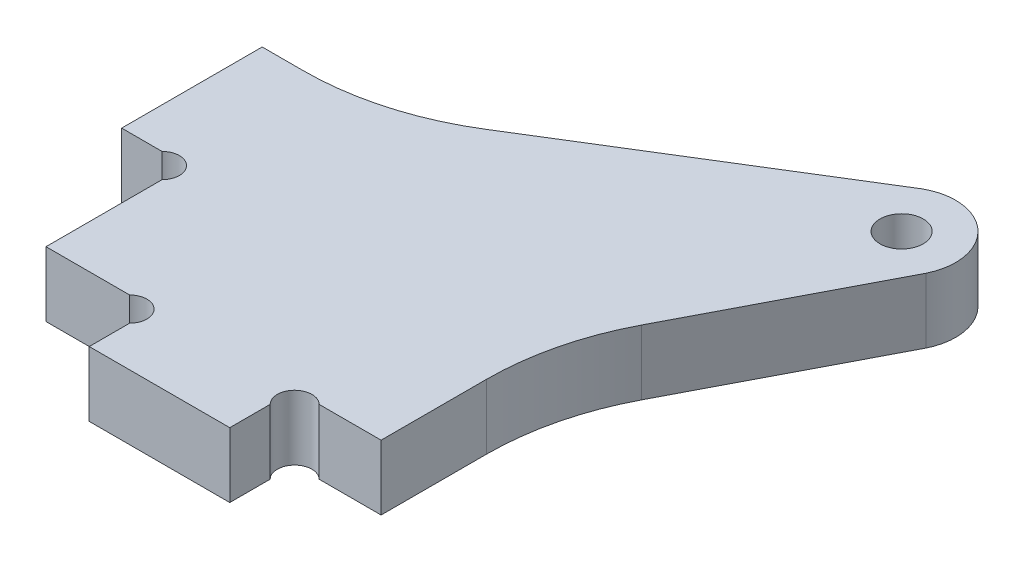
ISO-10303-21;
HEADER;
FILE_DESCRIPTION(('STEP AP214'),'2;1');
FILE_NAME('part.step','',(''),(''),'','','');
FILE_SCHEMA(('AUTOMOTIVE_DESIGN { 1 0 10303 214 1 1 1 1 }'));
ENDSEC;
DATA;
#1=APPLICATION_CONTEXT('core data for automotive mechanical design processes');
#2=APPLICATION_PROTOCOL_DEFINITION('international standard','automotive_design',2000,#1);
#3=PRODUCT_CONTEXT('',#1,'mechanical');
#4=PRODUCT('Part','Part','',(#3));
#5=PRODUCT_RELATED_PRODUCT_CATEGORY('part','',(#4));
#6=PRODUCT_DEFINITION_FORMATION('','',#4);
#7=PRODUCT_DEFINITION_CONTEXT('part definition',#1,'design');
#8=PRODUCT_DEFINITION('design','',#6,#7);
#9=PRODUCT_DEFINITION_SHAPE('','',#8);
#10=(LENGTH_UNIT() NAMED_UNIT(*) SI_UNIT(.MILLI.,.METRE.));
#11=(NAMED_UNIT(*) PLANE_ANGLE_UNIT() SI_UNIT($,.RADIAN.));
#12=(NAMED_UNIT(*) SI_UNIT($,.STERADIAN.) SOLID_ANGLE_UNIT());
#13=UNCERTAINTY_MEASURE_WITH_UNIT(LENGTH_MEASURE(1.E-05),#10,'distance_accuracy_value','');
#14=(GEOMETRIC_REPRESENTATION_CONTEXT(3) GLOBAL_UNCERTAINTY_ASSIGNED_CONTEXT((#13)) GLOBAL_UNIT_ASSIGNED_CONTEXT((#10,
#11,#12)) REPRESENTATION_CONTEXT('',''));
#15=CARTESIAN_POINT('',(0.,0.,0.));
#16=DIRECTION('',(0.,0.,1.));
#17=DIRECTION('',(1.,0.,0.));
#18=AXIS2_PLACEMENT_3D('',#15,#16,#17);
#19=CARTESIAN_POINT('',(8.86862915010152,6.,1.13137084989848));
#20=DIRECTION('',(0.,-1.,0.));
#21=DIRECTION('',(0.,0.,-1.));
#22=AXIS2_PLACEMENT_3D('',#19,#20,#21);
#23=PLANE('',#22);
#24=DIRECTION('',(1.,0.,0.));
#25=VECTOR('',#24,1.);
#26=CARTESIAN_POINT('',(0.,6.,0.));
#27=LINE('',#26,#25);
#28=CARTESIAN_POINT('',(0.,6.,0.));
#29=VERTEX_POINT('',#28);
#30=CARTESIAN_POINT('',(7.73725830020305,6.,0.));
#31=VERTEX_POINT('',#30);
#32=EDGE_CURVE('E199',#29,#31,#27,.T.);
#33=ORIENTED_EDGE('',*,*,#32,.T.);
#34=CARTESIAN_POINT('',(8.86862915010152,6.,1.13137084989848));
#35=DIRECTION('',(0.,-1.,0.));
#36=DIRECTION('',(0.,0.,-1.));
#37=AXIS2_PLACEMENT_3D('',#34,#35,#36);
#38=CIRCLE('',#37,1.6);
#39=CARTESIAN_POINT('',(10.,6.,2.26274169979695));
#40=VERTEX_POINT('',#39);
#41=EDGE_CURVE('E156',#31,#40,#38,.T.);
#42=ORIENTED_EDGE('',*,*,#41,.T.);
#43=DIRECTION('',(0.,0.,1.));
#44=VECTOR('',#43,1.);
#45=CARTESIAN_POINT('',(10.,6.,2.26274169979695));
#46=LINE('',#45,#44);
#47=CARTESIAN_POINT('',(10.,6.,6.00000000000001));
#48=VERTEX_POINT('',#47);
#49=EDGE_CURVE('E202',#40,#48,#46,.T.);
#50=ORIENTED_EDGE('',*,*,#49,.T.);
#51=DIRECTION('',(1.,0.,0.));
#52=VECTOR('',#51,1.);
#53=CARTESIAN_POINT('',(10.,6.,6.00000000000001));
#54=LINE('',#53,#52);
#55=CARTESIAN_POINT('',(23.,6.,6.00000000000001));
#56=VERTEX_POINT('',#55);
#57=EDGE_CURVE('E204',#48,#56,#54,.T.);
#58=ORIENTED_EDGE('',*,*,#57,.T.);
#59=DIRECTION('',(0.,0.,-1.));
#60=VECTOR('',#59,1.);
#61=CARTESIAN_POINT('',(23.,6.,6.00000000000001));
#62=LINE('',#61,#60);
#63=CARTESIAN_POINT('',(23.,6.,2.26274169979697));
#64=VERTEX_POINT('',#63);
#65=EDGE_CURVE('E206',#56,#64,#62,.T.);
#66=ORIENTED_EDGE('',*,*,#65,.T.);
#67=CARTESIAN_POINT('',(24.1313708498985,6.,1.13137084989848));
#68=DIRECTION('',(0.,-1.,0.));
#69=DIRECTION('',(0.,0.,1.));
#70=AXIS2_PLACEMENT_3D('',#67,#68,#69);
#71=CIRCLE('',#70,1.60000000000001);
#72=CARTESIAN_POINT('',(25.262741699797,6.,0.));
#73=VERTEX_POINT('',#72);
#74=EDGE_CURVE('E208',#64,#73,#71,.T.);
#75=ORIENTED_EDGE('',*,*,#74,.T.);
#76=DIRECTION('',(1.,0.,0.));
#77=VECTOR('',#76,1.);
#78=CARTESIAN_POINT('',(25.262741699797,6.,0.));
#79=LINE('',#78,#77);
#80=CARTESIAN_POINT('',(31.,6.,0.));
#81=VERTEX_POINT('',#80);
#82=EDGE_CURVE('E210',#73,#81,#79,.T.);
#83=ORIENTED_EDGE('',*,*,#82,.T.);
#84=DIRECTION('',(0.,0.,-1.));
#85=VECTOR('',#84,1.);
#86=CARTESIAN_POINT('',(31.,6.,-9.73463526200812));
#87=LINE('',#86,#85);
#88=CARTESIAN_POINT('',(31.,6.,-9.73463526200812));
#89=VERTEX_POINT('',#88);
#90=EDGE_CURVE('E212',#81,#89,#87,.T.);
#91=ORIENTED_EDGE('',*,*,#90,.T.);
#92=CARTESIAN_POINT('',(56.,6.,-9.73463526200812));
#93=DIRECTION('',(0.,-1.,0.));
#94=DIRECTION('',(0.,0.,1.));
#95=AXIS2_PLACEMENT_3D('',#92,#93,#94);
#96=CIRCLE('',#95,25.);
#97=CARTESIAN_POINT('',(33.8242159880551,6.,-21.277364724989));
#98=VERTEX_POINT('',#97);
#99=EDGE_CURVE('E214',#89,#98,#96,.T.);
#100=ORIENTED_EDGE('',*,*,#99,.T.);
#101=DIRECTION('',(0.461709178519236,0.,-0.887031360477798));
#102=VECTOR('',#101,1.);
#103=CARTESIAN_POINT('',(42.8240203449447,6.,-38.5677047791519));
#104=LINE('',#103,#102);
#105=CARTESIAN_POINT('',(42.8240203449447,6.,-38.5677047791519));
#106=VERTEX_POINT('',#105);
#107=EDGE_CURVE('E216',#98,#106,#104,.T.);
#108=ORIENTED_EDGE('',*,*,#107,.T.);
#109=CARTESIAN_POINT('',(38.35,6.,-40.8));
#110=DIRECTION('',(0.,1.,0.));
#111=DIRECTION('',(0.,0.,1.));
#112=AXIS2_PLACEMENT_3D('',#109,#110,#111);
#113=CIRCLE('',#112,5.);
#114=CARTESIAN_POINT('',(35.8291299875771,6.,-45.1180104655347));
#115=VERTEX_POINT('',#114);
#116=EDGE_CURVE('E218',#106,#115,#113,.T.);
#117=ORIENTED_EDGE('',*,*,#116,.T.);
#118=DIRECTION('',(-0.850852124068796,0.,0.525405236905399));
#119=VECTOR('',#118,1.);
#120=CARTESIAN_POINT('',(35.8291299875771,6.,-45.1180104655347));
#121=LINE('',#120,#119);
#122=CARTESIAN_POINT('',(10.9073568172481,6.,-29.7286968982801));
#123=VERTEX_POINT('',#122);
#124=EDGE_CURVE('E220',#115,#123,#121,.T.);
#125=ORIENTED_EDGE('',*,*,#124,.T.);
#126=CARTESIAN_POINT('',(-2.22777410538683,6.,-51.));
#127=DIRECTION('',(0.,-1.,0.));
#128=DIRECTION('',(0.,0.,-1.));
#129=AXIS2_PLACEMENT_3D('',#126,#127,#128);
#130=CIRCLE('',#129,25.);
#131=CARTESIAN_POINT('',(-2.22777410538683,6.,-26.));
#132=VERTEX_POINT('',#131);
#133=EDGE_CURVE('E222',#123,#132,#130,.T.);
#134=ORIENTED_EDGE('',*,*,#133,.T.);
#135=DIRECTION('',(-1.,0.,0.));
#136=VECTOR('',#135,1.);
#137=CARTESIAN_POINT('',(-6.,6.,-26.));
#138=LINE('',#137,#136);
#139=CARTESIAN_POINT('',(-6.,6.,-26.));
#140=VERTEX_POINT('',#139);
#141=EDGE_CURVE('E224',#132,#140,#138,.T.);
#142=ORIENTED_EDGE('',*,*,#141,.T.);
#143=DIRECTION('',(0.,0.,1.));
#144=VECTOR('',#143,1.);
#145=CARTESIAN_POINT('',(-6.,6.,-26.));
#146=LINE('',#145,#144);
#147=CARTESIAN_POINT('',(-5.99999999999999,6.,-13.));
#148=VERTEX_POINT('',#147);
#149=EDGE_CURVE('E226',#140,#148,#146,.T.);
#150=ORIENTED_EDGE('',*,*,#149,.T.);
#151=DIRECTION('',(1.,0.,0.));
#152=VECTOR('',#151,1.);
#153=CARTESIAN_POINT('',(-5.99999999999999,6.,-13.));
#154=LINE('',#153,#152);
#155=CARTESIAN_POINT('',(-2.26274169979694,6.,-13.));
#156=VERTEX_POINT('',#155);
#157=EDGE_CURVE('E228',#148,#156,#154,.T.);
#158=ORIENTED_EDGE('',*,*,#157,.T.);
#159=CARTESIAN_POINT('',(-1.13137084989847,6.,-11.8686291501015));
#160=DIRECTION('',(0.,-1.,0.));
#161=DIRECTION('',(0.,0.,1.));
#162=AXIS2_PLACEMENT_3D('',#159,#160,#161);
#163=CIRCLE('',#162,1.6);
#164=CARTESIAN_POINT('',(0.,6.,-10.737258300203));
#165=VERTEX_POINT('',#164);
#166=EDGE_CURVE('E37',#156,#165,#163,.T.);
#167=ORIENTED_EDGE('',*,*,#166,.T.);
#168=DIRECTION('',(0.,0.,1.));
#169=VECTOR('',#168,1.);
#170=CARTESIAN_POINT('',(0.,6.,-10.737258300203));
#171=LINE('',#170,#169);
#172=EDGE_CURVE('E32',#165,#29,#171,.T.);
#173=ORIENTED_EDGE('',*,*,#172,.T.);
#174=EDGE_LOOP('',(#33,#42,#50,#58,#66,#75,#83,#91,#100,#108,#117,#125,#134,#142,#150,#158,#167,#173));
#175=FACE_BOUND('',#174,.T.);
#176=CARTESIAN_POINT('',(38.35,6.,-40.8));
#177=DIRECTION('',(0.,1.,0.));
#178=DIRECTION('',(0.,0.,1.));
#179=AXIS2_PLACEMENT_3D('',#176,#177,#178);
#180=CIRCLE('',#179,2.);
#181=CARTESIAN_POINT('',(38.35,6.,-38.8));
#182=VERTEX_POINT('',#181);
#183=EDGE_CURVE('E161',#182,#182,#180,.T.);
#184=ORIENTED_EDGE('',*,*,#183,.F.);
#185=EDGE_LOOP('',(#184));
#186=FACE_BOUND('',#185,.T.);
#187=ADVANCED_FACE('F17',(#175,#186),#23,.F.);
#188=CARTESIAN_POINT('',(8.86862915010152,0.,1.13137084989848));
#189=DIRECTION('',(0.,-1.,0.));
#190=DIRECTION('',(0.,0.,-1.));
#191=AXIS2_PLACEMENT_3D('',#188,#189,#190);
#192=PLANE('',#191);
#193=DIRECTION('',(1.,0.,0.));
#194=VECTOR('',#193,1.);
#195=CARTESIAN_POINT('',(0.,0.,0.));
#196=LINE('',#195,#194);
#197=CARTESIAN_POINT('',(0.,0.,0.));
#198=VERTEX_POINT('',#197);
#199=CARTESIAN_POINT('',(7.73725830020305,0.,0.));
#200=VERTEX_POINT('',#199);
#201=EDGE_CURVE('E147',#198,#200,#196,.T.);
#202=ORIENTED_EDGE('',*,*,#201,.F.);
#203=DIRECTION('',(0.,0.,1.));
#204=VECTOR('',#203,1.);
#205=CARTESIAN_POINT('',(0.,0.,-10.737258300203));
#206=LINE('',#205,#204);
#207=CARTESIAN_POINT('',(0.,0.,-10.737258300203));
#208=VERTEX_POINT('',#207);
#209=EDGE_CURVE('E197',#208,#198,#206,.T.);
#210=ORIENTED_EDGE('',*,*,#209,.F.);
#211=CARTESIAN_POINT('',(-1.13137084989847,0.,-11.8686291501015));
#212=DIRECTION('',(0.,-1.,0.));
#213=DIRECTION('',(0.,0.,1.));
#214=AXIS2_PLACEMENT_3D('',#211,#212,#213);
#215=CIRCLE('',#214,1.6);
#216=CARTESIAN_POINT('',(-2.26274169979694,0.,-13.));
#217=VERTEX_POINT('',#216);
#218=EDGE_CURVE('E195',#217,#208,#215,.T.);
#219=ORIENTED_EDGE('',*,*,#218,.F.);
#220=DIRECTION('',(1.,0.,0.));
#221=VECTOR('',#220,1.);
#222=CARTESIAN_POINT('',(-5.99999999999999,0.,-13.));
#223=LINE('',#222,#221);
#224=CARTESIAN_POINT('',(-5.99999999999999,0.,-13.));
#225=VERTEX_POINT('',#224);
#226=EDGE_CURVE('E193',#225,#217,#223,.T.);
#227=ORIENTED_EDGE('',*,*,#226,.F.);
#228=DIRECTION('',(0.,0.,1.));
#229=VECTOR('',#228,1.);
#230=CARTESIAN_POINT('',(-6.,0.,-26.));
#231=LINE('',#230,#229);
#232=CARTESIAN_POINT('',(-6.,0.,-26.));
#233=VERTEX_POINT('',#232);
#234=EDGE_CURVE('E191',#233,#225,#231,.T.);
#235=ORIENTED_EDGE('',*,*,#234,.F.);
#236=DIRECTION('',(-1.,0.,0.));
#237=VECTOR('',#236,1.);
#238=CARTESIAN_POINT('',(-6.,0.,-26.));
#239=LINE('',#238,#237);
#240=CARTESIAN_POINT('',(-2.22777410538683,0.,-26.));
#241=VERTEX_POINT('',#240);
#242=EDGE_CURVE('E189',#241,#233,#239,.T.);
#243=ORIENTED_EDGE('',*,*,#242,.F.);
#244=CARTESIAN_POINT('',(-2.22777410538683,0.,-51.));
#245=DIRECTION('',(0.,-1.,0.));
#246=DIRECTION('',(0.,0.,-1.));
#247=AXIS2_PLACEMENT_3D('',#244,#245,#246);
#248=CIRCLE('',#247,25.);
#249=CARTESIAN_POINT('',(10.9073568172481,0.,-29.7286968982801));
#250=VERTEX_POINT('',#249);
#251=EDGE_CURVE('E187',#250,#241,#248,.T.);
#252=ORIENTED_EDGE('',*,*,#251,.F.);
#253=DIRECTION('',(-0.850852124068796,0.,0.525405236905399));
#254=VECTOR('',#253,1.);
#255=CARTESIAN_POINT('',(35.8291299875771,0.,-45.1180104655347));
#256=LINE('',#255,#254);
#257=CARTESIAN_POINT('',(35.8291299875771,0.,-45.1180104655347));
#258=VERTEX_POINT('',#257);
#259=EDGE_CURVE('E185',#258,#250,#256,.T.);
#260=ORIENTED_EDGE('',*,*,#259,.F.);
#261=CARTESIAN_POINT('',(38.35,0.,-40.8));
#262=DIRECTION('',(0.,1.,0.));
#263=DIRECTION('',(0.,0.,1.));
#264=AXIS2_PLACEMENT_3D('',#261,#262,#263);
#265=CIRCLE('',#264,5.);
#266=CARTESIAN_POINT('',(42.8240203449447,0.,-38.5677047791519));
#267=VERTEX_POINT('',#266);
#268=EDGE_CURVE('E183',#267,#258,#265,.T.);
#269=ORIENTED_EDGE('',*,*,#268,.F.);
#270=DIRECTION('',(0.461709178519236,0.,-0.887031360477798));
#271=VECTOR('',#270,1.);
#272=CARTESIAN_POINT('',(42.8240203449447,0.,-38.5677047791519));
#273=LINE('',#272,#271);
#274=CARTESIAN_POINT('',(33.8242159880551,0.,-21.277364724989));
#275=VERTEX_POINT('',#274);
#276=EDGE_CURVE('E181',#275,#267,#273,.T.);
#277=ORIENTED_EDGE('',*,*,#276,.F.);
#278=CARTESIAN_POINT('',(56.,0.,-9.73463526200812));
#279=DIRECTION('',(0.,-1.,0.));
#280=DIRECTION('',(0.,0.,1.));
#281=AXIS2_PLACEMENT_3D('',#278,#279,#280);
#282=CIRCLE('',#281,25.);
#283=CARTESIAN_POINT('',(31.,0.,-9.73463526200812));
#284=VERTEX_POINT('',#283);
#285=EDGE_CURVE('E179',#284,#275,#282,.T.);
#286=ORIENTED_EDGE('',*,*,#285,.F.);
#287=DIRECTION('',(0.,0.,-1.));
#288=VECTOR('',#287,1.);
#289=CARTESIAN_POINT('',(31.,0.,-9.73463526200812));
#290=LINE('',#289,#288);
#291=CARTESIAN_POINT('',(31.,0.,0.));
#292=VERTEX_POINT('',#291);
#293=EDGE_CURVE('E177',#292,#284,#290,.T.);
#294=ORIENTED_EDGE('',*,*,#293,.F.);
#295=DIRECTION('',(1.,0.,0.));
#296=VECTOR('',#295,1.);
#297=CARTESIAN_POINT('',(25.262741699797,0.,0.));
#298=LINE('',#297,#296);
#299=CARTESIAN_POINT('',(25.262741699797,0.,0.));
#300=VERTEX_POINT('',#299);
#301=EDGE_CURVE('E175',#300,#292,#298,.T.);
#302=ORIENTED_EDGE('',*,*,#301,.F.);
#303=CARTESIAN_POINT('',(24.1313708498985,0.,1.13137084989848));
#304=DIRECTION('',(0.,-1.,0.));
#305=DIRECTION('',(0.,0.,1.));
#306=AXIS2_PLACEMENT_3D('',#303,#304,#305);
#307=CIRCLE('',#306,1.60000000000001);
#308=CARTESIAN_POINT('',(23.,0.,2.26274169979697));
#309=VERTEX_POINT('',#308);
#310=EDGE_CURVE('E173',#309,#300,#307,.T.);
#311=ORIENTED_EDGE('',*,*,#310,.F.);
#312=DIRECTION('',(0.,0.,-1.));
#313=VECTOR('',#312,1.);
#314=CARTESIAN_POINT('',(23.,0.,6.00000000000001));
#315=LINE('',#314,#313);
#316=CARTESIAN_POINT('',(23.,0.,6.00000000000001));
#317=VERTEX_POINT('',#316);
#318=EDGE_CURVE('E171',#317,#309,#315,.T.);
#319=ORIENTED_EDGE('',*,*,#318,.F.);
#320=DIRECTION('',(1.,0.,0.));
#321=VECTOR('',#320,1.);
#322=CARTESIAN_POINT('',(10.,0.,6.00000000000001));
#323=LINE('',#322,#321);
#324=CARTESIAN_POINT('',(10.,0.,6.00000000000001));
#325=VERTEX_POINT('',#324);
#326=EDGE_CURVE('E169',#325,#317,#323,.T.);
#327=ORIENTED_EDGE('',*,*,#326,.F.);
#328=DIRECTION('',(0.,0.,1.));
#329=VECTOR('',#328,1.);
#330=CARTESIAN_POINT('',(10.,0.,2.26274169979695));
#331=LINE('',#330,#329);
#332=CARTESIAN_POINT('',(10.,0.,2.26274169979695));
#333=VERTEX_POINT('',#332);
#334=EDGE_CURVE('E149',#333,#325,#331,.T.);
#335=ORIENTED_EDGE('',*,*,#334,.F.);
#336=CARTESIAN_POINT('',(8.86862915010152,0.,1.13137084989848));
#337=DIRECTION('',(0.,-1.,0.));
#338=DIRECTION('',(0.,0.,-1.));
#339=AXIS2_PLACEMENT_3D('',#336,#337,#338);
#340=CIRCLE('',#339,1.6);
#341=EDGE_CURVE('E142',#200,#333,#340,.T.);
#342=ORIENTED_EDGE('',*,*,#341,.F.);
#343=EDGE_LOOP('',(#202,#210,#219,#227,#235,#243,#252,#260,#269,#277,#286,#294,#302,#311,#319,
#327,#335,#342));
#344=FACE_BOUND('',#343,.T.);
#345=CARTESIAN_POINT('',(38.35,0.,-40.8));
#346=DIRECTION('',(0.,1.,0.));
#347=DIRECTION('',(0.,0.,1.));
#348=AXIS2_PLACEMENT_3D('',#345,#346,#347);
#349=CIRCLE('',#348,2.);
#350=CARTESIAN_POINT('',(38.35,0.,-38.8));
#351=VERTEX_POINT('',#350);
#352=EDGE_CURVE('E164',#351,#351,#349,.T.);
#353=ORIENTED_EDGE('',*,*,#352,.T.);
#354=EDGE_LOOP('',(#353));
#355=FACE_BOUND('',#354,.T.);
#356=ADVANCED_FACE('F143',(#344,#355),#192,.T.);
#357=CARTESIAN_POINT('',(0.,6.,0.));
#358=DIRECTION('',(0.,0.,-1.));
#359=DIRECTION('',(-1.,0.,0.));
#360=AXIS2_PLACEMENT_3D('',#357,#358,#359);
#361=PLANE('',#360);
#362=ORIENTED_EDGE('',*,*,#201,.T.);
#363=DIRECTION('',(0.,-1.,0.));
#364=VECTOR('',#363,1.);
#365=CARTESIAN_POINT('',(7.73725830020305,6.,0.));
#366=LINE('',#365,#364);
#367=EDGE_CURVE('E11',#31,#200,#366,.T.);
#368=ORIENTED_EDGE('',*,*,#367,.F.);
#369=ORIENTED_EDGE('',*,*,#32,.F.);
#370=DIRECTION('',(0.,-1.,0.));
#371=VECTOR('',#370,1.);
#372=CARTESIAN_POINT('',(0.,6.,0.));
#373=LINE('',#372,#371);
#374=EDGE_CURVE('E160',#29,#198,#373,.T.);
#375=ORIENTED_EDGE('',*,*,#374,.T.);
#376=EDGE_LOOP('',(#362,#368,#369,#375));
#377=FACE_BOUND('',#376,.T.);
#378=ADVANCED_FACE('F19',(#377),#361,.F.);
#379=CARTESIAN_POINT('',(8.86862915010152,6.,1.13137084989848));
#380=DIRECTION('',(0.,-1.,0.));
#381=DIRECTION('',(0.,0.,-1.));
#382=AXIS2_PLACEMENT_3D('',#379,#380,#381);
#383=CYLINDRICAL_SURFACE('',#382,1.6);
#384=ORIENTED_EDGE('',*,*,#341,.T.);
#385=DIRECTION('',(0.,-1.,0.));
#386=VECTOR('',#385,1.);
#387=CARTESIAN_POINT('',(10.,6.,2.26274169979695));
#388=LINE('',#387,#386);
#389=EDGE_CURVE('E25',#40,#333,#388,.T.);
#390=ORIENTED_EDGE('',*,*,#389,.F.);
#391=ORIENTED_EDGE('',*,*,#41,.F.);
#392=ORIENTED_EDGE('',*,*,#367,.T.);
#393=EDGE_LOOP('',(#384,#390,#391,#392));
#394=FACE_BOUND('',#393,.T.);
#395=ADVANCED_FACE('F155',(#394),#383,.F.);
#396=CARTESIAN_POINT('',(10.,6.,2.26274169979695));
#397=DIRECTION('',(1.,0.,0.));
#398=DIRECTION('',(0.,0.,-1.));
#399=AXIS2_PLACEMENT_3D('',#396,#397,#398);
#400=PLANE('',#399);
#401=ORIENTED_EDGE('',*,*,#334,.T.);
#402=DIRECTION('',(0.,-1.,0.));
#403=VECTOR('',#402,1.);
#404=CARTESIAN_POINT('',(10.,6.,6.00000000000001));
#405=LINE('',#404,#403);
#406=EDGE_CURVE('E275',#48,#325,#405,.T.);
#407=ORIENTED_EDGE('',*,*,#406,.F.);
#408=ORIENTED_EDGE('',*,*,#49,.F.);
#409=ORIENTED_EDGE('',*,*,#389,.T.);
#410=EDGE_LOOP('',(#401,#407,#408,#409));
#411=FACE_BOUND('',#410,.T.);
#412=ADVANCED_FACE('F279',(#411),#400,.F.);
#413=CARTESIAN_POINT('',(10.,6.,6.00000000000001));
#414=DIRECTION('',(0.,0.,-1.));
#415=DIRECTION('',(-1.,0.,0.));
#416=AXIS2_PLACEMENT_3D('',#413,#414,#415);
#417=PLANE('',#416);
#418=ORIENTED_EDGE('',*,*,#326,.T.);
#419=DIRECTION('',(0.,-1.,0.));
#420=VECTOR('',#419,1.);
#421=CARTESIAN_POINT('',(23.,6.,6.00000000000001));
#422=LINE('',#421,#420);
#423=EDGE_CURVE('E272',#56,#317,#422,.T.);
#424=ORIENTED_EDGE('',*,*,#423,.F.);
#425=ORIENTED_EDGE('',*,*,#57,.F.);
#426=ORIENTED_EDGE('',*,*,#406,.T.);
#427=EDGE_LOOP('',(#418,#424,#425,#426));
#428=FACE_BOUND('',#427,.T.);
#429=ADVANCED_FACE('F287',(#428),#417,.F.);
#430=CARTESIAN_POINT('',(23.,6.,6.00000000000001));
#431=DIRECTION('',(-1.,0.,0.));
#432=DIRECTION('',(0.,0.,1.));
#433=AXIS2_PLACEMENT_3D('',#430,#431,#432);
#434=PLANE('',#433);
#435=ORIENTED_EDGE('',*,*,#318,.T.);
#436=DIRECTION('',(0.,-1.,0.));
#437=VECTOR('',#436,1.);
#438=CARTESIAN_POINT('',(23.,6.,2.26274169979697));
#439=LINE('',#438,#437);
#440=EDGE_CURVE('E269',#64,#309,#439,.T.);
#441=ORIENTED_EDGE('',*,*,#440,.F.);
#442=ORIENTED_EDGE('',*,*,#65,.F.);
#443=ORIENTED_EDGE('',*,*,#423,.T.);
#444=EDGE_LOOP('',(#435,#441,#442,#443));
#445=FACE_BOUND('',#444,.T.);
#446=ADVANCED_FACE('F290',(#445),#434,.F.);
#447=CARTESIAN_POINT('',(24.1313708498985,6.,1.13137084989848));
#448=DIRECTION('',(0.,-1.,0.));
#449=DIRECTION('',(0.,0.,-1.));
#450=AXIS2_PLACEMENT_3D('',#447,#448,#449);
#451=CYLINDRICAL_SURFACE('',#450,1.60000000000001);
#452=ORIENTED_EDGE('',*,*,#310,.T.);
#453=DIRECTION('',(0.,-1.,0.));
#454=VECTOR('',#453,1.);
#455=CARTESIAN_POINT('',(25.262741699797,6.,0.));
#456=LINE('',#455,#454);
#457=EDGE_CURVE('E266',#73,#300,#456,.T.);
#458=ORIENTED_EDGE('',*,*,#457,.F.);
#459=ORIENTED_EDGE('',*,*,#74,.F.);
#460=ORIENTED_EDGE('',*,*,#440,.T.);
#461=EDGE_LOOP('',(#452,#458,#459,#460));
#462=FACE_BOUND('',#461,.T.);
#463=ADVANCED_FACE('F295',(#462),#451,.F.);
#464=CARTESIAN_POINT('',(25.262741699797,6.,0.));
#465=DIRECTION('',(0.,0.,-1.));
#466=DIRECTION('',(-1.,0.,0.));
#467=AXIS2_PLACEMENT_3D('',#464,#465,#466);
#468=PLANE('',#467);
#469=ORIENTED_EDGE('',*,*,#301,.T.);
#470=DIRECTION('',(0.,-1.,0.));
#471=VECTOR('',#470,1.);
#472=CARTESIAN_POINT('',(31.,6.,0.));
#473=LINE('',#472,#471);
#474=EDGE_CURVE('E263',#81,#292,#473,.T.);
#475=ORIENTED_EDGE('',*,*,#474,.F.);
#476=ORIENTED_EDGE('',*,*,#82,.F.);
#477=ORIENTED_EDGE('',*,*,#457,.T.);
#478=EDGE_LOOP('',(#469,#475,#476,#477));
#479=FACE_BOUND('',#478,.T.);
#480=ADVANCED_FACE('F301',(#479),#468,.F.);
#481=CARTESIAN_POINT('',(31.,6.,-9.73463526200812));
#482=DIRECTION('',(-1.,0.,0.));
#483=DIRECTION('',(0.,0.,1.));
#484=AXIS2_PLACEMENT_3D('',#481,#482,#483);
#485=PLANE('',#484);
#486=ORIENTED_EDGE('',*,*,#293,.T.);
#487=DIRECTION('',(0.,-1.,0.));
#488=VECTOR('',#487,1.);
#489=CARTESIAN_POINT('',(31.,6.,-9.73463526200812));
#490=LINE('',#489,#488);
#491=EDGE_CURVE('E260',#89,#284,#490,.T.);
#492=ORIENTED_EDGE('',*,*,#491,.F.);
#493=ORIENTED_EDGE('',*,*,#90,.F.);
#494=ORIENTED_EDGE('',*,*,#474,.T.);
#495=EDGE_LOOP('',(#486,#492,#493,#494));
#496=FACE_BOUND('',#495,.T.);
#497=ADVANCED_FACE('F305',(#496),#485,.F.);
#498=CARTESIAN_POINT('',(56.,6.,-9.73463526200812));
#499=DIRECTION('',(0.,-1.,0.));
#500=DIRECTION('',(0.,0.,-1.));
#501=AXIS2_PLACEMENT_3D('',#498,#499,#500);
#502=CYLINDRICAL_SURFACE('',#501,25.);
#503=ORIENTED_EDGE('',*,*,#285,.T.);
#504=DIRECTION('',(0.,-1.,0.));
#505=VECTOR('',#504,1.);
#506=CARTESIAN_POINT('',(33.8242159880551,6.,-21.277364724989));
#507=LINE('',#506,#505);
#508=EDGE_CURVE('E257',#98,#275,#507,.T.);
#509=ORIENTED_EDGE('',*,*,#508,.F.);
#510=ORIENTED_EDGE('',*,*,#99,.F.);
#511=ORIENTED_EDGE('',*,*,#491,.T.);
#512=EDGE_LOOP('',(#503,#509,#510,#511));
#513=FACE_BOUND('',#512,.T.);
#514=ADVANCED_FACE('F310',(#513),#502,.F.);
#515=CARTESIAN_POINT('',(42.8240203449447,6.,-38.5677047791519));
#516=DIRECTION('',(-0.887031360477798,0.,-0.461709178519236));
#517=DIRECTION('',(-0.461709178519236,0.,0.887031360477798));
#518=AXIS2_PLACEMENT_3D('',#515,#516,#517);
#519=PLANE('',#518);
#520=ORIENTED_EDGE('',*,*,#276,.T.);
#521=DIRECTION('',(0.,-1.,0.));
#522=VECTOR('',#521,1.);
#523=CARTESIAN_POINT('',(42.8240203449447,6.,-38.5677047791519));
#524=LINE('',#523,#522);
#525=EDGE_CURVE('E254',#106,#267,#524,.T.);
#526=ORIENTED_EDGE('',*,*,#525,.F.);
#527=ORIENTED_EDGE('',*,*,#107,.F.);
#528=ORIENTED_EDGE('',*,*,#508,.T.);
#529=EDGE_LOOP('',(#520,#526,#527,#528));
#530=FACE_BOUND('',#529,.T.);
#531=ADVANCED_FACE('F316',(#530),#519,.F.);
#532=CARTESIAN_POINT('',(38.35,6.,-40.8));
#533=DIRECTION('',(0.,-1.,0.));
#534=DIRECTION('',(0.,0.,-1.));
#535=AXIS2_PLACEMENT_3D('',#532,#533,#534);
#536=CYLINDRICAL_SURFACE('',#535,5.);
#537=ORIENTED_EDGE('',*,*,#268,.T.);
#538=DIRECTION('',(0.,-1.,0.));
#539=VECTOR('',#538,1.);
#540=CARTESIAN_POINT('',(35.8291299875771,6.,-45.1180104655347));
#541=LINE('',#540,#539);
#542=EDGE_CURVE('E251',#115,#258,#541,.T.);
#543=ORIENTED_EDGE('',*,*,#542,.F.);
#544=ORIENTED_EDGE('',*,*,#116,.F.);
#545=ORIENTED_EDGE('',*,*,#525,.T.);
#546=EDGE_LOOP('',(#537,#543,#544,#545));
#547=FACE_BOUND('',#546,.T.);
#548=ADVANCED_FACE('F320',(#547),#536,.T.);
#549=CARTESIAN_POINT('',(35.8291299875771,6.,-45.1180104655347));
#550=DIRECTION('',(0.525405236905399,0.,0.850852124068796));
#551=DIRECTION('',(0.850852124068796,0.,-0.525405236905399));
#552=AXIS2_PLACEMENT_3D('',#549,#550,#551);
#553=PLANE('',#552);
#554=ORIENTED_EDGE('',*,*,#259,.T.);
#555=DIRECTION('',(0.,-1.,0.));
#556=VECTOR('',#555,1.);
#557=CARTESIAN_POINT('',(10.9073568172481,6.,-29.7286968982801));
#558=LINE('',#557,#556);
#559=EDGE_CURVE('E248',#123,#250,#558,.T.);
#560=ORIENTED_EDGE('',*,*,#559,.F.);
#561=ORIENTED_EDGE('',*,*,#124,.F.);
#562=ORIENTED_EDGE('',*,*,#542,.T.);
#563=EDGE_LOOP('',(#554,#560,#561,#562));
#564=FACE_BOUND('',#563,.T.);
#565=ADVANCED_FACE('F325',(#564),#553,.F.);
#566=CARTESIAN_POINT('',(-2.22777410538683,6.,-51.));
#567=DIRECTION('',(0.,-1.,0.));
#568=DIRECTION('',(0.,0.,-1.));
#569=AXIS2_PLACEMENT_3D('',#566,#567,#568);
#570=CYLINDRICAL_SURFACE('',#569,25.);
#571=ORIENTED_EDGE('',*,*,#251,.T.);
#572=DIRECTION('',(0.,-1.,0.));
#573=VECTOR('',#572,1.);
#574=CARTESIAN_POINT('',(-2.22777410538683,6.,-26.));
#575=LINE('',#574,#573);
#576=EDGE_CURVE('E245',#132,#241,#575,.T.);
#577=ORIENTED_EDGE('',*,*,#576,.F.);
#578=ORIENTED_EDGE('',*,*,#133,.F.);
#579=ORIENTED_EDGE('',*,*,#559,.T.);
#580=EDGE_LOOP('',(#571,#577,#578,#579));
#581=FACE_BOUND('',#580,.T.);
#582=ADVANCED_FACE('F331',(#581),#570,.F.);
#583=CARTESIAN_POINT('',(-6.,6.,-26.));
#584=DIRECTION('',(0.,0.,1.));
#585=DIRECTION('',(1.,0.,0.));
#586=AXIS2_PLACEMENT_3D('',#583,#584,#585);
#587=PLANE('',#586);
#588=ORIENTED_EDGE('',*,*,#242,.T.);
#589=DIRECTION('',(0.,-1.,0.));
#590=VECTOR('',#589,1.);
#591=CARTESIAN_POINT('',(-6.,6.,-26.));
#592=LINE('',#591,#590);
#593=EDGE_CURVE('E242',#140,#233,#592,.T.);
#594=ORIENTED_EDGE('',*,*,#593,.F.);
#595=ORIENTED_EDGE('',*,*,#141,.F.);
#596=ORIENTED_EDGE('',*,*,#576,.T.);
#597=EDGE_LOOP('',(#588,#594,#595,#596));
#598=FACE_BOUND('',#597,.T.);
#599=ADVANCED_FACE('F335',(#598),#587,.F.);
#600=CARTESIAN_POINT('',(-6.,6.,-26.));
#601=DIRECTION('',(1.,0.,0.));
#602=DIRECTION('',(0.,0.,-1.));
#603=AXIS2_PLACEMENT_3D('',#600,#601,#602);
#604=PLANE('',#603);
#605=ORIENTED_EDGE('',*,*,#234,.T.);
#606=DIRECTION('',(0.,-1.,0.));
#607=VECTOR('',#606,1.);
#608=CARTESIAN_POINT('',(-5.99999999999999,6.,-13.));
#609=LINE('',#608,#607);
#610=EDGE_CURVE('E239',#148,#225,#609,.T.);
#611=ORIENTED_EDGE('',*,*,#610,.F.);
#612=ORIENTED_EDGE('',*,*,#149,.F.);
#613=ORIENTED_EDGE('',*,*,#593,.T.);
#614=EDGE_LOOP('',(#605,#611,#612,#613));
#615=FACE_BOUND('',#614,.T.);
#616=ADVANCED_FACE('F340',(#615),#604,.F.);
#617=CARTESIAN_POINT('',(-5.99999999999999,6.,-13.));
#618=DIRECTION('',(0.,0.,-1.));
#619=DIRECTION('',(-1.,0.,0.));
#620=AXIS2_PLACEMENT_3D('',#617,#618,#619);
#621=PLANE('',#620);
#622=ORIENTED_EDGE('',*,*,#226,.T.);
#623=DIRECTION('',(0.,-1.,0.));
#624=VECTOR('',#623,1.);
#625=CARTESIAN_POINT('',(-2.26274169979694,6.,-13.));
#626=LINE('',#625,#624);
#627=EDGE_CURVE('E236',#156,#217,#626,.T.);
#628=ORIENTED_EDGE('',*,*,#627,.F.);
#629=ORIENTED_EDGE('',*,*,#157,.F.);
#630=ORIENTED_EDGE('',*,*,#610,.T.);
#631=EDGE_LOOP('',(#622,#628,#629,#630));
#632=FACE_BOUND('',#631,.T.);
#633=ADVANCED_FACE('F344',(#632),#621,.F.);
#634=CARTESIAN_POINT('',(-1.13137084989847,6.,-11.8686291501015));
#635=DIRECTION('',(0.,-1.,0.));
#636=DIRECTION('',(0.,0.,-1.));
#637=AXIS2_PLACEMENT_3D('',#634,#635,#636);
#638=CYLINDRICAL_SURFACE('',#637,1.6);
#639=ORIENTED_EDGE('',*,*,#218,.T.);
#640=DIRECTION('',(0.,-1.,0.));
#641=VECTOR('',#640,1.);
#642=CARTESIAN_POINT('',(0.,6.,-10.737258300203));
#643=LINE('',#642,#641);
#644=EDGE_CURVE('E233',#165,#208,#643,.T.);
#645=ORIENTED_EDGE('',*,*,#644,.F.);
#646=ORIENTED_EDGE('',*,*,#166,.F.);
#647=ORIENTED_EDGE('',*,*,#627,.T.);
#648=EDGE_LOOP('',(#639,#645,#646,#647));
#649=FACE_BOUND('',#648,.T.);
#650=ADVANCED_FACE('F348',(#649),#638,.F.);
#651=CARTESIAN_POINT('',(0.,6.,-10.737258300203));
#652=DIRECTION('',(1.,0.,0.));
#653=DIRECTION('',(0.,0.,-1.));
#654=AXIS2_PLACEMENT_3D('',#651,#652,#653);
#655=PLANE('',#654);
#656=ORIENTED_EDGE('',*,*,#209,.T.);
#657=ORIENTED_EDGE('',*,*,#374,.F.);
#658=ORIENTED_EDGE('',*,*,#172,.F.);
#659=ORIENTED_EDGE('',*,*,#644,.T.);
#660=EDGE_LOOP('',(#656,#657,#658,#659));
#661=FACE_BOUND('',#660,.T.);
#662=ADVANCED_FACE('F350',(#661),#655,.F.);
#663=CARTESIAN_POINT('',(38.35,6.,-40.8));
#664=DIRECTION('',(0.,-1.,0.));
#665=DIRECTION('',(0.,0.,-1.));
#666=AXIS2_PLACEMENT_3D('',#663,#664,#665);
#667=CYLINDRICAL_SURFACE('',#666,2.);
#668=ORIENTED_EDGE('',*,*,#183,.T.);
#669=EDGE_LOOP('',(#668));
#670=FACE_BOUND('',#669,.T.);
#671=ORIENTED_EDGE('',*,*,#352,.F.);
#672=EDGE_LOOP('',(#671));
#673=FACE_BOUND('',#672,.T.);
#674=ADVANCED_FACE('F352',(#670,#673),#667,.F.);
#675=CLOSED_SHELL('',(#187,#356,#378,#395,#412,#429,#446,#463,#480,#497,#514,#531,#548,#565,
#582,#599,#616,#633,#650,#662,#674));
#676=MANIFOLD_SOLID_BREP('B1',#675);
#677=ADVANCED_BREP_SHAPE_REPRESENTATION('',(#18,#676),#14);
#678=SHAPE_DEFINITION_REPRESENTATION(#9,#677);
ENDSEC;
END-ISO-10303-21;
